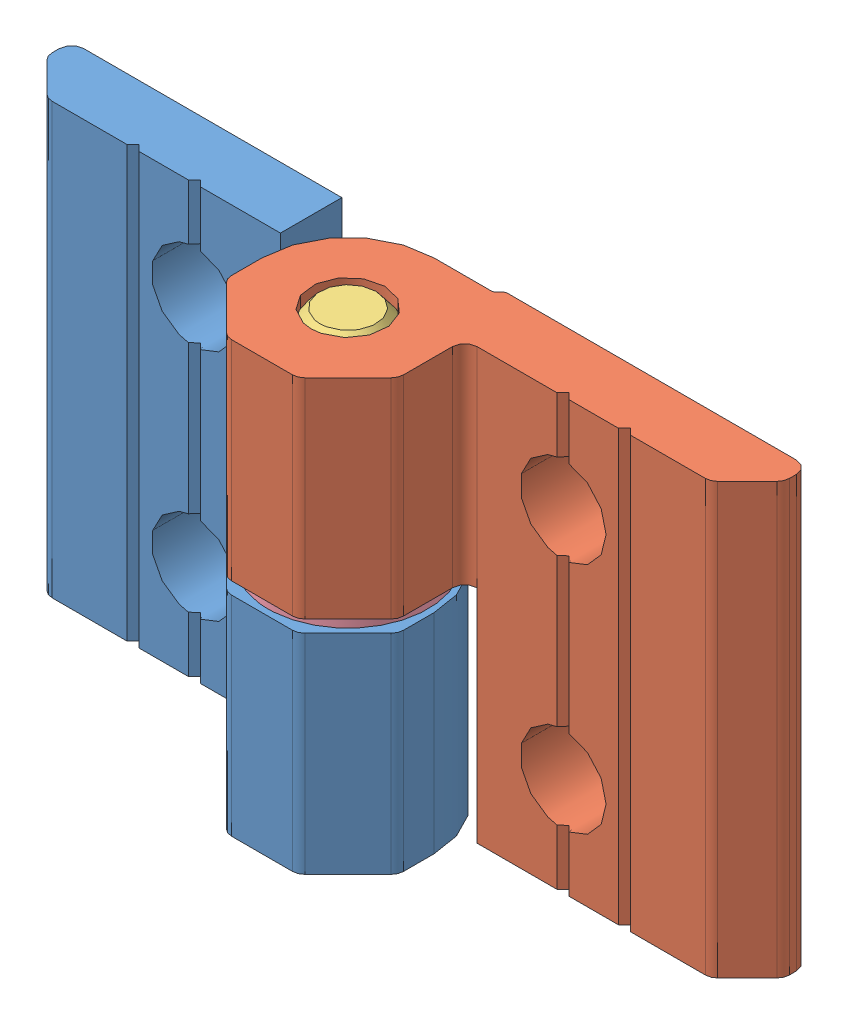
SolidWorks assembly J3HL.SLDASM, configuration Default (file format 7000). Lengths in mm.
Overall size (60 35 14.5).
4 component instances, 4 part files, 7 mates.
Components (placement in the parent):
- J3HL-1-1: J3HL-1.SLDPRT [Default] at origin size (37 35 14.5)
- J3HL-2-1: J3HL-2.SLDPRT [Default] at origin size (37 35 14.5)
- J3HL-3-1: J3HL-3.SLDPRT [Default] at origin size (6.3 35 6.3)
- J3HL-4-1: J3HL-4.SLDPRT [Default] at (0 17 0) x (0.999517 0 0.031091) z (-0.031091 0 0.999517) size (13 1 13)
Mates (geometry in assembly coordinates):
- 同心円1: concentric anti-aligned: cylinder of J3HL-1-1 through (0 35 0) axis (0 -1 0) radius 3; cone of ? through (0 0 0) axis (0 1 0)
- 一致1: coincident aligned: plane of J3HL-1-1 through (-29 0 -5.9142) normal (0 -1 0); plane of ? through (0 0 0) normal (0 -1 0)
- 同心円2: concentric anti-aligned: cone of ? through (0 0 0) axis (0 1 0); cylinder of J3HL-4-1 through (0 18 0) axis (0 -1 0) radius 3
- 一致2: coincident anti-aligned: plane of J3HL-1-1 through (17.8242 17 27.5) normal (0 1 0); plane of J3HL-4-1 through (0 17 0) normal (0 -1 0)
- 同心円3: concentric anti-aligned: cylinder of J3HL-2-1 through (0 35 0) axis (0 -1 0) radius 3; cone of ? through (0 0 0) axis (0 1 0)
- 一致3: coincident aligned: plane of J3HL-2-1 through (29 35 -5.9142) normal (0 1 0); plane of ? through (0 35 0) normal (0 1 0)
- 角度1: planar angle aligned: plane of J3HL-2-1 through (26.5858 35 -2.5) normal (0 0 1); plane of J3HL-1-1 through (-26.5858 35 -2.5) normal (0 0 1)
